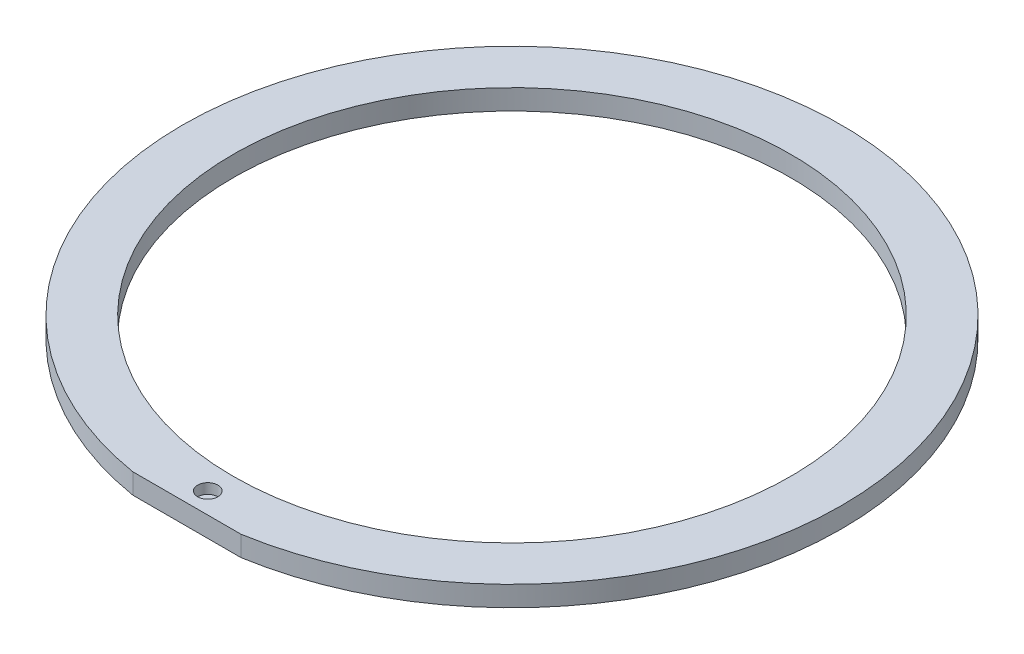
ISO-10303-21;
HEADER;
FILE_DESCRIPTION(('STEP AP214'),'2;1');
FILE_NAME('part.step','',(''),(''),'','','');
FILE_SCHEMA(('AUTOMOTIVE_DESIGN { 1 0 10303 214 1 1 1 1 }'));
ENDSEC;
DATA;
#1=APPLICATION_CONTEXT('core data for automotive mechanical design processes');
#2=APPLICATION_PROTOCOL_DEFINITION('international standard','automotive_design',2000,#1);
#3=PRODUCT_CONTEXT('',#1,'mechanical');
#4=PRODUCT('Part','Part','',(#3));
#5=PRODUCT_RELATED_PRODUCT_CATEGORY('part','',(#4));
#6=PRODUCT_DEFINITION_FORMATION('','',#4);
#7=PRODUCT_DEFINITION_CONTEXT('part definition',#1,'design');
#8=PRODUCT_DEFINITION('design','',#6,#7);
#9=PRODUCT_DEFINITION_SHAPE('','',#8);
#10=(LENGTH_UNIT() NAMED_UNIT(*) SI_UNIT(.MILLI.,.METRE.));
#11=(NAMED_UNIT(*) PLANE_ANGLE_UNIT() SI_UNIT($,.RADIAN.));
#12=(NAMED_UNIT(*) SI_UNIT($,.STERADIAN.) SOLID_ANGLE_UNIT());
#13=UNCERTAINTY_MEASURE_WITH_UNIT(LENGTH_MEASURE(1.E-05),#10,'distance_accuracy_value','');
#14=(GEOMETRIC_REPRESENTATION_CONTEXT(3) GLOBAL_UNCERTAINTY_ASSIGNED_CONTEXT((#13)) GLOBAL_UNIT_ASSIGNED_CONTEXT((#10,
#11,#12)) REPRESENTATION_CONTEXT('',''));
#15=CARTESIAN_POINT('',(0.,0.,0.));
#16=DIRECTION('',(0.,0.,1.));
#17=DIRECTION('',(1.,0.,0.));
#18=AXIS2_PLACEMENT_3D('',#15,#16,#17);
#19=CARTESIAN_POINT('',(0.,2.,32.0583041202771));
#20=DIRECTION('',(0.,0.,-1.));
#21=DIRECTION('',(-1.,0.,0.));
#22=AXIS2_PLACEMENT_3D('',#19,#20,#21);
#23=PLANE('',#22);
#24=DIRECTION('',(1.,0.,0.));
#25=VECTOR('',#24,1.);
#26=CARTESIAN_POINT('',(0.,0.,32.0583041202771));
#27=LINE('',#26,#25);
#28=CARTESIAN_POINT('',(-5.3399566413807,0.,32.0583041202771));
#29=VERTEX_POINT('',#28);
#30=CARTESIAN_POINT('',(5.3399566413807,0.,32.0583041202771));
#31=VERTEX_POINT('',#30);
#32=EDGE_CURVE('E65',#29,#31,#27,.T.);
#33=ORIENTED_EDGE('',*,*,#32,.T.);
#34=DIRECTION('',(0.,-1.,0.));
#35=VECTOR('',#34,1.);
#36=CARTESIAN_POINT('',(5.3399566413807,2.,32.0583041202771));
#37=LINE('',#36,#35);
#38=CARTESIAN_POINT('',(5.3399566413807,2.,32.0583041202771));
#39=VERTEX_POINT('',#38);
#40=EDGE_CURVE('E11',#39,#31,#37,.T.);
#41=ORIENTED_EDGE('',*,*,#40,.F.);
#42=DIRECTION('',(1.,0.,0.));
#43=VECTOR('',#42,1.);
#44=CARTESIAN_POINT('',(0.,2.,32.0583041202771));
#45=LINE('',#44,#43);
#46=CARTESIAN_POINT('',(-5.3399566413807,2.,32.0583041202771));
#47=VERTEX_POINT('',#46);
#48=EDGE_CURVE('E68',#47,#39,#45,.T.);
#49=ORIENTED_EDGE('',*,*,#48,.F.);
#50=DIRECTION('',(0.,-1.,0.));
#51=VECTOR('',#50,1.);
#52=CARTESIAN_POINT('',(-5.3399566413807,2.,32.0583041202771));
#53=LINE('',#52,#51);
#54=EDGE_CURVE('E42',#47,#29,#53,.T.);
#55=ORIENTED_EDGE('',*,*,#54,.T.);
#56=EDGE_LOOP('',(#33,#41,#49,#55));
#57=FACE_BOUND('',#56,.T.);
#58=ADVANCED_FACE('F33',(#57),#23,.F.);
#59=CARTESIAN_POINT('',(0.,2.,0.));
#60=DIRECTION('',(0.,-1.,0.));
#61=DIRECTION('',(0.,0.,-1.));
#62=AXIS2_PLACEMENT_3D('',#59,#60,#61);
#63=CYLINDRICAL_SURFACE('',#62,27.5);
#64=CARTESIAN_POINT('',(0.,2.,0.));
#65=DIRECTION('',(0.,1.,0.));
#66=DIRECTION('',(0.,0.,1.));
#67=AXIS2_PLACEMENT_3D('',#64,#65,#66);
#68=CIRCLE('',#67,27.5);
#69=CARTESIAN_POINT('',(0.,2.,27.5));
#70=VERTEX_POINT('',#69);
#71=EDGE_CURVE('E64',#70,#70,#68,.T.);
#72=ORIENTED_EDGE('',*,*,#71,.T.);
#73=EDGE_LOOP('',(#72));
#74=FACE_BOUND('',#73,.T.);
#75=CARTESIAN_POINT('',(0.,0.,0.));
#76=DIRECTION('',(0.,1.,0.));
#77=DIRECTION('',(0.,0.,1.));
#78=AXIS2_PLACEMENT_3D('',#75,#76,#77);
#79=CIRCLE('',#78,27.5);
#80=CARTESIAN_POINT('',(0.,0.,27.5));
#81=VERTEX_POINT('',#80);
#82=EDGE_CURVE('E70',#81,#81,#79,.T.);
#83=ORIENTED_EDGE('',*,*,#82,.F.);
#84=EDGE_LOOP('',(#83));
#85=FACE_BOUND('',#84,.T.);
#86=ADVANCED_FACE('F35',(#74,#85),#63,.F.);
#87=CARTESIAN_POINT('',(0.,2.,0.));
#88=DIRECTION('',(0.,-1.,0.));
#89=DIRECTION('',(0.,0.,-1.));
#90=AXIS2_PLACEMENT_3D('',#87,#88,#89);
#91=CYLINDRICAL_SURFACE('',#90,32.5);
#92=CARTESIAN_POINT('',(0.,0.,0.));
#93=DIRECTION('',(0.,1.,0.));
#94=DIRECTION('',(0.,0.,1.));
#95=AXIS2_PLACEMENT_3D('',#92,#93,#94);
#96=CIRCLE('',#95,32.5);
#97=EDGE_CURVE('E57',#31,#29,#96,.T.);
#98=ORIENTED_EDGE('',*,*,#97,.T.);
#99=ORIENTED_EDGE('',*,*,#54,.F.);
#100=CARTESIAN_POINT('',(0.,2.,0.));
#101=DIRECTION('',(0.,1.,0.));
#102=DIRECTION('',(0.,0.,1.));
#103=AXIS2_PLACEMENT_3D('',#100,#101,#102);
#104=CIRCLE('',#103,32.5);
#105=EDGE_CURVE('E49',#39,#47,#104,.T.);
#106=ORIENTED_EDGE('',*,*,#105,.F.);
#107=ORIENTED_EDGE('',*,*,#40,.T.);
#108=EDGE_LOOP('',(#98,#99,#106,#107));
#109=FACE_BOUND('',#108,.T.);
#110=ADVANCED_FACE('F60',(#109),#91,.T.);
#111=CARTESIAN_POINT('',(0.,2.,0.));
#112=DIRECTION('',(0.,1.,0.));
#113=DIRECTION('',(0.,0.,1.));
#114=AXIS2_PLACEMENT_3D('',#111,#112,#113);
#115=PLANE('',#114);
#116=CARTESIAN_POINT('',(0.,2.,30.));
#117=DIRECTION('',(0.,1.,0.));
#118=DIRECTION('',(0.,0.,1.));
#119=AXIS2_PLACEMENT_3D('',#116,#117,#118);
#120=CIRCLE('',#119,1.);
#121=CARTESIAN_POINT('',(0.,2.,31.));
#122=VERTEX_POINT('',#121);
#123=EDGE_CURVE('E80',#122,#122,#120,.T.);
#124=ORIENTED_EDGE('',*,*,#123,.F.);
#125=EDGE_LOOP('',(#124));
#126=FACE_BOUND('',#125,.T.);
#127=ORIENTED_EDGE('',*,*,#71,.F.);
#128=EDGE_LOOP('',(#127));
#129=FACE_BOUND('',#128,.T.);
#130=ORIENTED_EDGE('',*,*,#48,.T.);
#131=ORIENTED_EDGE('',*,*,#105,.T.);
#132=EDGE_LOOP('',(#130,#131));
#133=FACE_BOUND('',#132,.T.);
#134=ADVANCED_FACE('F94',(#126,#129,#133),#115,.T.);
#135=CARTESIAN_POINT('',(0.,0.,0.));
#136=DIRECTION('',(0.,1.,0.));
#137=DIRECTION('',(0.,0.,1.));
#138=AXIS2_PLACEMENT_3D('',#135,#136,#137);
#139=PLANE('',#138);
#140=ORIENTED_EDGE('',*,*,#82,.T.);
#141=EDGE_LOOP('',(#140));
#142=FACE_BOUND('',#141,.T.);
#143=ORIENTED_EDGE('',*,*,#32,.F.);
#144=ORIENTED_EDGE('',*,*,#97,.F.);
#145=EDGE_LOOP('',(#143,#144));
#146=FACE_BOUND('',#145,.T.);
#147=ADVANCED_FACE('F69',(#142,#146),#139,.F.);
#148=CARTESIAN_POINT('',(0.,1.,30.));
#149=DIRECTION('',(0.,1.,0.));
#150=DIRECTION('',(0.,0.,1.));
#151=AXIS2_PLACEMENT_3D('',#148,#149,#150);
#152=CYLINDRICAL_SURFACE('',#151,1.);
#153=CARTESIAN_POINT('',(0.,1.,30.));
#154=DIRECTION('',(0.,1.,0.));
#155=DIRECTION('',(0.,0.,1.));
#156=AXIS2_PLACEMENT_3D('',#153,#154,#155);
#157=CIRCLE('',#156,1.);
#158=CARTESIAN_POINT('',(0.,1.,31.));
#159=VERTEX_POINT('',#158);
#160=EDGE_CURVE('E73',#159,#159,#157,.T.);
#161=ORIENTED_EDGE('',*,*,#160,.F.);
#162=EDGE_LOOP('',(#161));
#163=FACE_BOUND('',#162,.T.);
#164=ORIENTED_EDGE('',*,*,#123,.T.);
#165=EDGE_LOOP('',(#164));
#166=FACE_BOUND('',#165,.T.);
#167=ADVANCED_FACE('F88',(#163,#166),#152,.F.);
#168=CARTESIAN_POINT('',(0.,1.,30.));
#169=DIRECTION('',(0.,1.,0.));
#170=DIRECTION('',(0.,0.,1.));
#171=AXIS2_PLACEMENT_3D('',#168,#169,#170);
#172=PLANE('',#171);
#173=ORIENTED_EDGE('',*,*,#160,.T.);
#174=EDGE_LOOP('',(#173));
#175=FACE_BOUND('',#174,.T.);
#176=ADVANCED_FACE('F86',(#175),#172,.T.);
#177=CLOSED_SHELL('',(#58,#86,#110,#134,#147,#167,#176));
#178=MANIFOLD_SOLID_BREP('B2',#177);
#179=ADVANCED_BREP_SHAPE_REPRESENTATION('',(#18,#178),#14);
#180=SHAPE_DEFINITION_REPRESENTATION(#9,#179);
ENDSEC;
END-ISO-10303-21;
